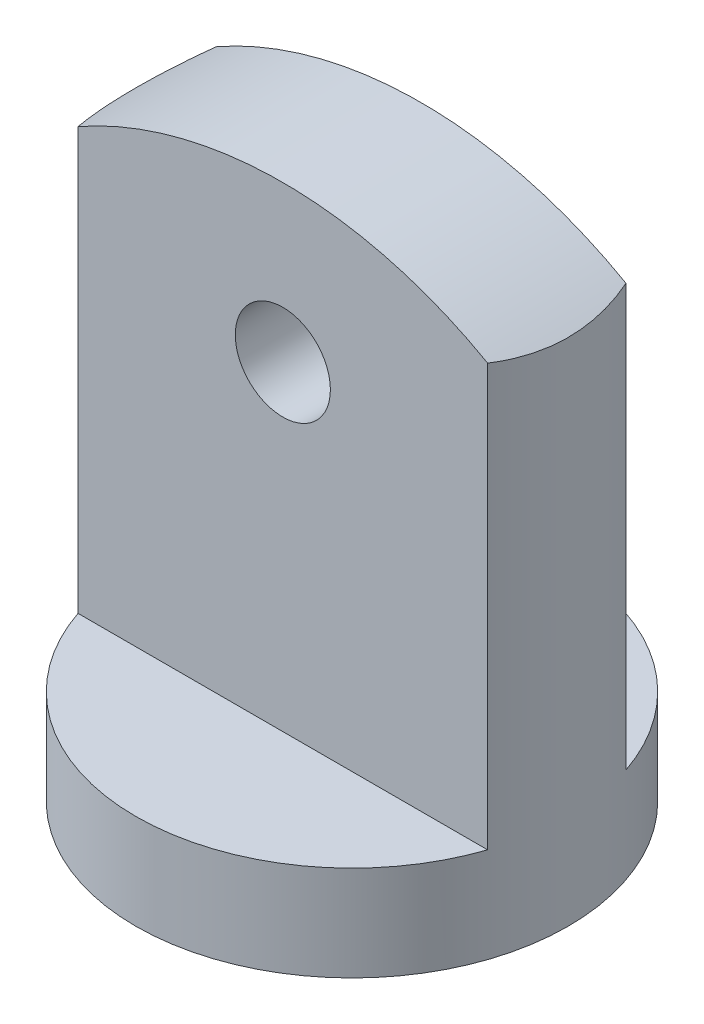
ISO-10303-21;
HEADER;
FILE_DESCRIPTION(('STEP AP214'),'2;1');
FILE_NAME('part.step','',(''),(''),'','','');
FILE_SCHEMA(('AUTOMOTIVE_DESIGN { 1 0 10303 214 1 1 1 1 }'));
ENDSEC;
DATA;
#1=APPLICATION_CONTEXT('core data for automotive mechanical design processes');
#2=APPLICATION_PROTOCOL_DEFINITION('international standard','automotive_design',2000,#1);
#3=PRODUCT_CONTEXT('',#1,'mechanical');
#4=PRODUCT('Part','Part','',(#3));
#5=PRODUCT_RELATED_PRODUCT_CATEGORY('part','',(#4));
#6=PRODUCT_DEFINITION_FORMATION('','',#4);
#7=PRODUCT_DEFINITION_CONTEXT('part definition',#1,'design');
#8=PRODUCT_DEFINITION('design','',#6,#7);
#9=PRODUCT_DEFINITION_SHAPE('','',#8);
#10=(LENGTH_UNIT() NAMED_UNIT(*) SI_UNIT(.MILLI.,.METRE.));
#11=(NAMED_UNIT(*) PLANE_ANGLE_UNIT() SI_UNIT($,.RADIAN.));
#12=(NAMED_UNIT(*) SI_UNIT($,.STERADIAN.) SOLID_ANGLE_UNIT());
#13=UNCERTAINTY_MEASURE_WITH_UNIT(LENGTH_MEASURE(1.E-05),#10,'distance_accuracy_value','');
#14=(GEOMETRIC_REPRESENTATION_CONTEXT(3) GLOBAL_UNCERTAINTY_ASSIGNED_CONTEXT((#13)) GLOBAL_UNIT_ASSIGNED_CONTEXT((#10,
#11,#12)) REPRESENTATION_CONTEXT('',''));
#15=CARTESIAN_POINT('',(0.,0.,0.));
#16=DIRECTION('',(0.,0.,1.));
#17=DIRECTION('',(1.,0.,0.));
#18=AXIS2_PLACEMENT_3D('',#15,#16,#17);
#19=CARTESIAN_POINT('',(0.,0.,0.8));
#20=DIRECTION('',(0.,0.,-1.));
#21=DIRECTION('',(-1.,0.,0.));
#22=AXIS2_PLACEMENT_3D('',#19,#20,#21);
#23=PLANE('',#22);
#24=CARTESIAN_POINT('',(0.,4.8,0.8));
#25=DIRECTION('',(0.,0.,1.));
#26=DIRECTION('',(1.,0.,0.));
#27=AXIS2_PLACEMENT_3D('',#24,#25,#26);
#28=CIRCLE('',#27,0.55);
#29=CARTESIAN_POINT('',(0.55,4.8,0.8));
#30=VERTEX_POINT('',#29);
#31=EDGE_CURVE('E169',#30,#30,#28,.T.);
#32=ORIENTED_EDGE('',*,*,#31,.F.);
#33=EDGE_LOOP('',(#32));
#34=FACE_BOUND('',#33,.T.);
#35=DIRECTION('',(1.,0.,0.));
#36=VECTOR('',#35,1.);
#37=CARTESIAN_POINT('',(-2.5,1.1,0.8));
#38=LINE('',#37,#36);
#39=CARTESIAN_POINT('',(-2.3685438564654,1.1,0.8));
#40=VERTEX_POINT('',#39);
#41=CARTESIAN_POINT('',(2.3685438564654,1.1,0.8));
#42=VERTEX_POINT('',#41);
#43=EDGE_CURVE('E88',#40,#42,#38,.T.);
#44=ORIENTED_EDGE('',*,*,#43,.T.);
#45=DIRECTION('',(0.,-1.,0.));
#46=VECTOR('',#45,1.);
#47=CARTESIAN_POINT('',(2.3685438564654,6.7,0.8));
#48=LINE('',#47,#46);
#49=CARTESIAN_POINT('',(2.3685438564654,5.97492514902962,0.8));
#50=VERTEX_POINT('',#49);
#51=EDGE_CURVE('E74',#42,#50,#48,.F.);
#52=ORIENTED_EDGE('',*,*,#51,.T.);
#53=CARTESIAN_POINT('',(0.,1.8,0.8));
#54=DIRECTION('',(0.,0.,-1.));
#55=DIRECTION('',(-1.,0.,0.));
#56=AXIS2_PLACEMENT_3D('',#53,#54,#55);
#57=CIRCLE('',#56,4.8);
#58=CARTESIAN_POINT('',(-2.3685438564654,5.97492514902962,0.8));
#59=VERTEX_POINT('',#58);
#60=EDGE_CURVE('E100',#59,#50,#57,.T.);
#61=ORIENTED_EDGE('',*,*,#60,.F.);
#62=DIRECTION('',(0.,-1.,0.));
#63=VECTOR('',#62,1.);
#64=CARTESIAN_POINT('',(-2.3685438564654,6.7,0.8));
#65=LINE('',#64,#63);
#66=EDGE_CURVE('E92',#59,#40,#65,.T.);
#67=ORIENTED_EDGE('',*,*,#66,.T.);
#68=EDGE_LOOP('',(#44,#52,#61,#67));
#69=FACE_BOUND('',#68,.T.);
#70=ADVANCED_FACE('F32',(#34,#69),#23,.F.);
#71=CARTESIAN_POINT('',(0.,0.,-0.8));
#72=DIRECTION('',(0.,0.,-1.));
#73=DIRECTION('',(-1.,0.,0.));
#74=AXIS2_PLACEMENT_3D('',#71,#72,#73);
#75=PLANE('',#74);
#76=DIRECTION('',(0.,-1.,0.));
#77=VECTOR('',#76,1.);
#78=CARTESIAN_POINT('',(2.3685438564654,6.7,-0.8));
#79=LINE('',#78,#77);
#80=CARTESIAN_POINT('',(2.3685438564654,1.1,-0.8));
#81=VERTEX_POINT('',#80);
#82=CARTESIAN_POINT('',(2.3685438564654,5.97492514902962,-0.8));
#83=VERTEX_POINT('',#82);
#84=EDGE_CURVE('E83',#81,#83,#79,.F.);
#85=ORIENTED_EDGE('',*,*,#84,.F.);
#86=DIRECTION('',(1.,0.,0.));
#87=VECTOR('',#86,1.);
#88=CARTESIAN_POINT('',(-2.5,1.1,-0.8));
#89=LINE('',#88,#87);
#90=CARTESIAN_POINT('',(-2.3685438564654,1.1,-0.8));
#91=VERTEX_POINT('',#90);
#92=EDGE_CURVE('E93',#91,#81,#89,.T.);
#93=ORIENTED_EDGE('',*,*,#92,.F.);
#94=DIRECTION('',(0.,-1.,0.));
#95=VECTOR('',#94,1.);
#96=CARTESIAN_POINT('',(-2.3685438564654,6.7,-0.8));
#97=LINE('',#96,#95);
#98=CARTESIAN_POINT('',(-2.3685438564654,5.97492514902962,-0.8));
#99=VERTEX_POINT('',#98);
#100=EDGE_CURVE('E82',#99,#91,#97,.T.);
#101=ORIENTED_EDGE('',*,*,#100,.F.);
#102=CARTESIAN_POINT('',(0.,1.8,-0.8));
#103=DIRECTION('',(0.,0.,-1.));
#104=DIRECTION('',(-1.,0.,0.));
#105=AXIS2_PLACEMENT_3D('',#102,#103,#104);
#106=CIRCLE('',#105,4.8);
#107=EDGE_CURVE('E96',#99,#83,#106,.T.);
#108=ORIENTED_EDGE('',*,*,#107,.T.);
#109=EDGE_LOOP('',(#85,#93,#101,#108));
#110=FACE_BOUND('',#109,.T.);
#111=CARTESIAN_POINT('',(0.,4.8,-0.8));
#112=DIRECTION('',(0.,0.,1.));
#113=DIRECTION('',(1.,0.,0.));
#114=AXIS2_PLACEMENT_3D('',#111,#112,#113);
#115=CIRCLE('',#114,0.55);
#116=CARTESIAN_POINT('',(0.55,4.8,-0.8));
#117=VERTEX_POINT('',#116);
#118=EDGE_CURVE('E170',#117,#117,#115,.T.);
#119=ORIENTED_EDGE('',*,*,#118,.T.);
#120=EDGE_LOOP('',(#119));
#121=FACE_BOUND('',#120,.T.);
#122=ADVANCED_FACE('F131',(#110,#121),#75,.T.);
#123=CARTESIAN_POINT('',(0.,1.1,0.));
#124=DIRECTION('',(0.,1.,0.));
#125=DIRECTION('',(0.,0.,1.));
#126=AXIS2_PLACEMENT_3D('',#123,#124,#125);
#127=PLANE('',#126);
#128=CARTESIAN_POINT('',(0.,1.1,0.));
#129=DIRECTION('',(0.,1.,0.));
#130=DIRECTION('',(0.,0.,1.));
#131=AXIS2_PLACEMENT_3D('',#128,#129,#130);
#132=CIRCLE('',#131,2.5);
#133=EDGE_CURVE('E89',#81,#91,#132,.T.);
#134=ORIENTED_EDGE('',*,*,#133,.T.);
#135=ORIENTED_EDGE('',*,*,#92,.T.);
#136=EDGE_LOOP('',(#134,#135));
#137=FACE_BOUND('',#136,.T.);
#138=ADVANCED_FACE('F136',(#137),#127,.T.);
#139=CARTESIAN_POINT('',(0.,1.1,0.));
#140=DIRECTION('',(0.,-1.,0.));
#141=DIRECTION('',(0.,0.,-1.));
#142=AXIS2_PLACEMENT_3D('',#139,#140,#141);
#143=CYLINDRICAL_SURFACE('',#142,2.5);
#144=ORIENTED_EDGE('',*,*,#66,.F.);
#145=CARTESIAN_POINT('',(-2.3685438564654,5.97492514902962,0.8));
#146=CARTESIAN_POINT('',(-2.38795891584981,5.9639043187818,0.742538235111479));
#147=CARTESIAN_POINT('',(-2.40533195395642,5.95387486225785,0.684184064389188));
#148=CARTESIAN_POINT('',(-2.43584496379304,5.93605915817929,0.566018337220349));
#149=CARTESIAN_POINT('',(-2.44898307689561,5.92827389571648,0.506206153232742));
#150=CARTESIAN_POINT('',(-2.47085685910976,5.91521899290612,0.385519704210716));
#151=CARTESIAN_POINT('',(-2.47959375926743,5.90994864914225,0.32464574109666));
#152=CARTESIAN_POINT('',(-2.49256419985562,5.9020940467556,0.202274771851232));
#153=CARTESIAN_POINT('',(-2.49679870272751,5.89950921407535,0.14077790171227));
#154=CARTESIAN_POINT('',(-2.50264983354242,5.89595117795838,-0.0443277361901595));
#155=CARTESIAN_POINT('',(-2.49737319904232,5.89919944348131,-0.168326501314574));
#156=CARTESIAN_POINT('',(-2.46869935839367,5.91652471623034,-0.41315725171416));
#157=CARTESIAN_POINT('',(-2.44533899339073,5.9305797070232,-0.533995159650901));
#158=CARTESIAN_POINT('',(-2.40681596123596,5.95298610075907,-0.676693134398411));
#159=CARTESIAN_POINT('',(-2.39967883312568,5.95711615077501,-0.701578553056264));
#160=CARTESIAN_POINT('',(-2.38466452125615,5.9657474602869,-0.751025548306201));
#161=CARTESIAN_POINT('',(-2.37678826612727,5.9702482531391,-0.775587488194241));
#162=CARTESIAN_POINT('',(-2.36854385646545,5.97492514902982,-0.799999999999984));
#163=B_SPLINE_CURVE_WITH_KNOTS('',3,(#145,#146,#147,#148,#149,#150,#151,#152,#153,#154,#155,
#156,#157,#158,#159,#160,#161,#162),.UNSPECIFIED.,.F.,.F.,(4,2,2,2,2,2,2,2,4),(0.,
0.184907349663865,0.369895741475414,0.554832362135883,0.739729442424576,1.11020448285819,
1.47992675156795,1.55856838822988,1.63711251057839),.UNSPECIFIED.);
#164=EDGE_CURVE('E11',#59,#99,#163,.T.);
#165=ORIENTED_EDGE('',*,*,#164,.T.);
#166=ORIENTED_EDGE('',*,*,#100,.T.);
#167=ORIENTED_EDGE('',*,*,#133,.F.);
#168=ORIENTED_EDGE('',*,*,#84,.T.);
#169=CARTESIAN_POINT('',(2.3685438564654,5.97492514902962,-0.8));
#170=CARTESIAN_POINT('',(2.38795891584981,5.9639043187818,-0.742538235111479));
#171=CARTESIAN_POINT('',(2.40533195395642,5.95387486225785,-0.684184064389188));
#172=CARTESIAN_POINT('',(2.43584496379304,5.93605915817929,-0.566018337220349));
#173=CARTESIAN_POINT('',(2.44898307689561,5.92827389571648,-0.506206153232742));
#174=CARTESIAN_POINT('',(2.47085685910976,5.91521899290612,-0.385519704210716));
#175=CARTESIAN_POINT('',(2.47959375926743,5.90994864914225,-0.32464574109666));
#176=CARTESIAN_POINT('',(2.49256419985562,5.9020940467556,-0.202274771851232));
#177=CARTESIAN_POINT('',(2.49679870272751,5.89950921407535,-0.14077790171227));
#178=CARTESIAN_POINT('',(2.50264983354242,5.89595117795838,0.0443277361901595));
#179=CARTESIAN_POINT('',(2.49737319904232,5.89919944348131,0.168326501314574));
#180=CARTESIAN_POINT('',(2.46869935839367,5.91652471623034,0.41315725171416));
#181=CARTESIAN_POINT('',(2.44533899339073,5.9305797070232,0.533995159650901));
#182=CARTESIAN_POINT('',(2.40681596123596,5.95298610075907,0.676693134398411));
#183=CARTESIAN_POINT('',(2.39967883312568,5.95711615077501,0.701578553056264));
#184=CARTESIAN_POINT('',(2.38466452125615,5.9657474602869,0.751025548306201));
#185=CARTESIAN_POINT('',(2.37678826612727,5.9702482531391,0.775587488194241));
#186=CARTESIAN_POINT('',(2.36854385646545,5.97492514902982,0.799999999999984));
#187=B_SPLINE_CURVE_WITH_KNOTS('',3,(#169,#170,#171,#172,#173,#174,#175,#176,#177,#178,#179,
#180,#181,#182,#183,#184,#185,#186),.UNSPECIFIED.,.F.,.F.,(4,2,2,2,2,2,2,2,4),(0.,
0.184907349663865,0.369895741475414,0.554832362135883,0.739729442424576,1.11020448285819,
1.47992675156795,1.55856838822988,1.63711251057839),.UNSPECIFIED.);
#188=EDGE_CURVE('E45',#83,#50,#187,.T.);
#189=ORIENTED_EDGE('',*,*,#188,.T.);
#190=ORIENTED_EDGE('',*,*,#51,.F.);
#191=EDGE_CURVE('E77',#40,#42,#132,.T.);
#192=ORIENTED_EDGE('',*,*,#191,.F.);
#193=EDGE_LOOP('',(#144,#165,#166,#167,#168,#189,#190,#192));
#194=FACE_BOUND('',#193,.T.);
#195=CARTESIAN_POINT('',(0.,0.,0.));
#196=DIRECTION('',(0.,1.,0.));
#197=DIRECTION('',(0.,0.,1.));
#198=AXIS2_PLACEMENT_3D('',#195,#196,#197);
#199=CIRCLE('',#198,2.5);
#200=CARTESIAN_POINT('',(0.,0.,2.5));
#201=VERTEX_POINT('',#200);
#202=EDGE_CURVE('E90',#201,#201,#199,.T.);
#203=ORIENTED_EDGE('',*,*,#202,.T.);
#204=EDGE_LOOP('',(#203));
#205=FACE_BOUND('',#204,.T.);
#206=ADVANCED_FACE('F34',(#194,#205),#143,.T.);
#207=ORIENTED_EDGE('',*,*,#43,.F.);
#208=ORIENTED_EDGE('',*,*,#191,.T.);
#209=EDGE_LOOP('',(#207,#208));
#210=FACE_BOUND('',#209,.T.);
#211=ADVANCED_FACE('F87',(#210),#127,.T.);
#212=CARTESIAN_POINT('',(0.,0.,0.));
#213=DIRECTION('',(0.,1.,0.));
#214=DIRECTION('',(0.,0.,1.));
#215=AXIS2_PLACEMENT_3D('',#212,#213,#214);
#216=PLANE('',#215);
#217=CARTESIAN_POINT('',(0.,0.,0.));
#218=DIRECTION('',(0.,-1.,0.));
#219=DIRECTION('',(0.,0.,-1.));
#220=AXIS2_PLACEMENT_3D('',#217,#218,#219);
#221=CIRCLE('',#220,1.);
#222=CARTESIAN_POINT('',(0.,0.,-1.));
#223=VERTEX_POINT('',#222);
#224=EDGE_CURVE('E149',#223,#223,#221,.T.);
#225=ORIENTED_EDGE('',*,*,#224,.F.);
#226=EDGE_LOOP('',(#225));
#227=FACE_BOUND('',#226,.T.);
#228=ORIENTED_EDGE('',*,*,#202,.F.);
#229=EDGE_LOOP('',(#228));
#230=FACE_BOUND('',#229,.T.);
#231=ADVANCED_FACE('F127',(#227,#230),#216,.F.);
#232=CARTESIAN_POINT('',(0.,1.8,14.8908022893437));
#233=DIRECTION('',(0.,0.,-1.));
#234=DIRECTION('',(-1.,0.,0.));
#235=AXIS2_PLACEMENT_3D('',#232,#233,#234);
#236=CYLINDRICAL_SURFACE('',#235,4.8);
#237=ORIENTED_EDGE('',*,*,#164,.F.);
#238=ORIENTED_EDGE('',*,*,#60,.T.);
#239=ORIENTED_EDGE('',*,*,#188,.F.);
#240=ORIENTED_EDGE('',*,*,#107,.F.);
#241=EDGE_LOOP('',(#237,#238,#239,#240));
#242=FACE_BOUND('',#241,.T.);
#243=ADVANCED_FACE('F109',(#242),#236,.T.);
#244=CARTESIAN_POINT('',(0.,4.8,-0.8));
#245=DIRECTION('',(0.,0.,1.));
#246=DIRECTION('',(1.,0.,0.));
#247=AXIS2_PLACEMENT_3D('',#244,#245,#246);
#248=CYLINDRICAL_SURFACE('',#247,0.55);
#249=ORIENTED_EDGE('',*,*,#118,.F.);
#250=EDGE_LOOP('',(#249));
#251=FACE_BOUND('',#250,.T.);
#252=ORIENTED_EDGE('',*,*,#31,.T.);
#253=EDGE_LOOP('',(#252));
#254=FACE_BOUND('',#253,.T.);
#255=ADVANCED_FACE('F117',(#251,#254),#248,.F.);
#256=CARTESIAN_POINT('',(0.,1.,0.));
#257=DIRECTION('',(0.,-1.,0.));
#258=DIRECTION('',(0.,0.,-1.));
#259=AXIS2_PLACEMENT_3D('',#256,#257,#258);
#260=CYLINDRICAL_SURFACE('',#259,1.);
#261=CARTESIAN_POINT('',(0.,1.,0.));
#262=DIRECTION('',(0.,-1.,0.));
#263=DIRECTION('',(0.,0.,-1.));
#264=AXIS2_PLACEMENT_3D('',#261,#262,#263);
#265=CIRCLE('',#264,1.);
#266=CARTESIAN_POINT('',(0.,1.,-1.));
#267=VERTEX_POINT('',#266);
#268=EDGE_CURVE('E161',#267,#267,#265,.T.);
#269=ORIENTED_EDGE('',*,*,#268,.F.);
#270=EDGE_LOOP('',(#269));
#271=FACE_BOUND('',#270,.T.);
#272=ORIENTED_EDGE('',*,*,#224,.T.);
#273=EDGE_LOOP('',(#272));
#274=FACE_BOUND('',#273,.T.);
#275=ADVANCED_FACE('F115',(#271,#274),#260,.F.);
#276=CARTESIAN_POINT('',(0.,1.,0.));
#277=DIRECTION('',(0.,-1.,0.));
#278=DIRECTION('',(0.,0.,-1.));
#279=AXIS2_PLACEMENT_3D('',#276,#277,#278);
#280=PLANE('',#279);
#281=ORIENTED_EDGE('',*,*,#268,.T.);
#282=EDGE_LOOP('',(#281));
#283=FACE_BOUND('',#282,.T.);
#284=ADVANCED_FACE('F125',(#283),#280,.T.);
#285=CLOSED_SHELL('',(#70,#122,#138,#206,#211,#231,#243,#255,#275,#284));
#286=MANIFOLD_SOLID_BREP('B2',#285);
#287=ADVANCED_BREP_SHAPE_REPRESENTATION('',(#18,#286),#14);
#288=SHAPE_DEFINITION_REPRESENTATION(#9,#287);
ENDSEC;
END-ISO-10303-21;
